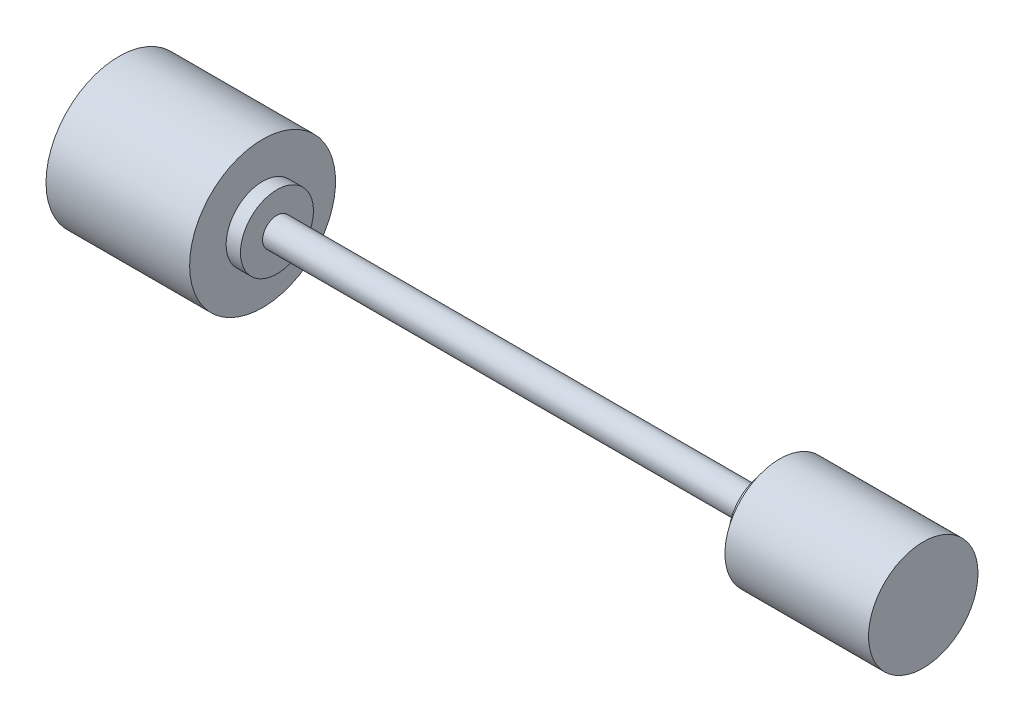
from build123d import *

# Parameters (mm, degrees)
SKETCH1_R      = 10
EXTRUDE1_DEPTH = 340
SKETCH2_R      = 25.4
EXTRUDE2_DEPTH = 10
SKETCH3_R      = 38.1
EXTRUDE3_DEPTH = 100
EXTRUDE4_START = 10
SKETCH4_R      = 25.4
EXTRUDE4_DEPTH = 10
SKETCH5_R      = 50.8
EXTRUDE5_DEPTH = 100


with BuildPart() as part:
    # Sketch1 → Extrude1 (new body)
    with BuildSketch(Plane(origin=(0, 0, 0), x_dir=(0, 0, -1), z_dir=(1, 0, 0))):
        Circle(SKETCH1_R)
    extrude(amount=EXTRUDE1_DEPTH)

    # Sketch2 → Extrude2 (add)
    with BuildSketch(Plane(origin=(340, 0, 0), x_dir=(0, 0, -1), z_dir=(1, 0, 0))):
        Circle(SKETCH2_R)
    extrude(amount=EXTRUDE2_DEPTH)

    # Sketch3 → Extrude3 (add)
    with BuildSketch(Plane(origin=(350, 0, 0), x_dir=(0, 0, -1), z_dir=(1, 0, 0))):
        Circle(SKETCH3_R)
    extrude(amount=EXTRUDE3_DEPTH)

    # Sketch4 → Extrude4 (add)
    with BuildSketch(Plane.ZY.offset(EXTRUDE4_START)):
        with Locations(Location((0, 0, 0), (0, 0, 180))):
            Circle(SKETCH4_R)
    extrude(amount=-EXTRUDE4_DEPTH)

    # Sketch5 → Extrude5 (add)
    with BuildSketch(Plane.ZY.offset(10)):
        Circle(SKETCH5_R)
    extrude(amount=EXTRUDE5_DEPTH)


solid = part.part
